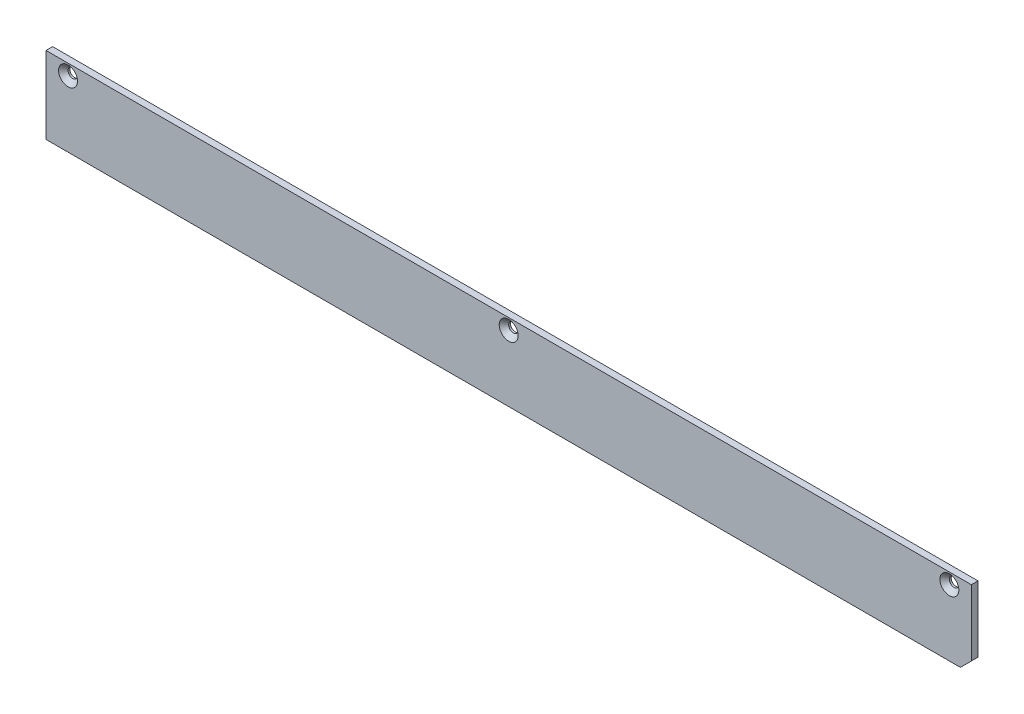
from build123d import *

# Parameters (mm, degrees)
SKETCH_1_W          = 420
SKETCH_1_H          = 35
EXTRUDE_1_DEPTH     = 3
SKETCH_2_R          = 4.3
CUT_EXTRUDE_1_DEPTH = 2.15
DRAFT_1_ANGLE       = 45
DRAFT_2_ANGLE       = 45
DRAFT_3_ANGLE       = 45
SKETCH_3_R          = 2.15
CUT_EXTRUDE_2_DEPTH = 422.46129419
SKETCH_4_R          = 2.15
CUT_EXTRUDE_3_DEPTH = 422.46129419
SKETCH_5_R          = 2.15
CUT_EXTRUDE_4_DEPTH = 422.46129419
CHAMFER_1_SIZE      = 5


with BuildPart() as part:
    # Sketch 1 → Extrude 1 (new body)
    with BuildSketch(Plane.XY):
        with Locations((210, 17.5)):
            Rectangle(SKETCH_1_W, SKETCH_1_H)
    extrude(amount=EXTRUDE_1_DEPTH)

    # Sketch 2 → Cut-Extrude 1 (cut)
    with BuildSketch(Plane.XY.offset(3)):
        with Locations((10, 30)):
            Circle(SKETCH_2_R)
        with Locations((210, 30)):
            Circle(SKETCH_2_R)
        with Locations((410, 30)):
            Circle(SKETCH_2_R)
    extrude(amount=-CUT_EXTRUDE_1_DEPTH, mode=Mode.SUBTRACT)

    # Draft 1
    draft_1_faces = [part.faces().sort_by_distance(p)[0] for p in [
        (5.7, 30, 1.925),
    ]]
    draft(draft_1_faces, Plane.XY.offset(3), DRAFT_1_ANGLE)

    # Draft 2
    draft_2_faces = [part.faces().sort_by_distance(p)[0] for p in [
        (205.7, 30, 1.925),
    ]]
    draft(draft_2_faces, Plane.XY.offset(3), DRAFT_2_ANGLE)

    # Draft 3
    draft_3_faces = [part.faces().sort_by_distance(p)[0] for p in [
        (405.7, 30, 1.925),
    ]]
    draft(draft_3_faces, Plane.XY.offset(3), DRAFT_3_ANGLE)

    # Sketch 3 → Cut-Extrude 2 (cut, through all)
    with BuildSketch(Plane.XY.offset(0.85)):
        with Locations((10, 30)):
            Circle(SKETCH_3_R)
    extrude(amount=-CUT_EXTRUDE_2_DEPTH, mode=Mode.SUBTRACT)

    # Sketch 4 → Cut-Extrude 3 (cut, through all)
    with BuildSketch(Plane.XY.offset(0.85)):
        with Locations((210, 30)):
            Circle(SKETCH_4_R)
    extrude(amount=-CUT_EXTRUDE_3_DEPTH, mode=Mode.SUBTRACT)

    # Sketch 5 → Cut-Extrude 4 (cut, through all)
    with BuildSketch(Plane.XY.offset(0.85)):
        with Locations((410, 30)):
            Circle(SKETCH_5_R)
    extrude(amount=-CUT_EXTRUDE_4_DEPTH, mode=Mode.SUBTRACT)

    # Chamfer 1
    chamfer_1_edges = [part.edges().sort_by_distance(p)[0] for p in [
        (420, 0, 1.5),
    ]]
    chamfer(chamfer_1_edges, length=CHAMFER_1_SIZE)


solid = part.part
